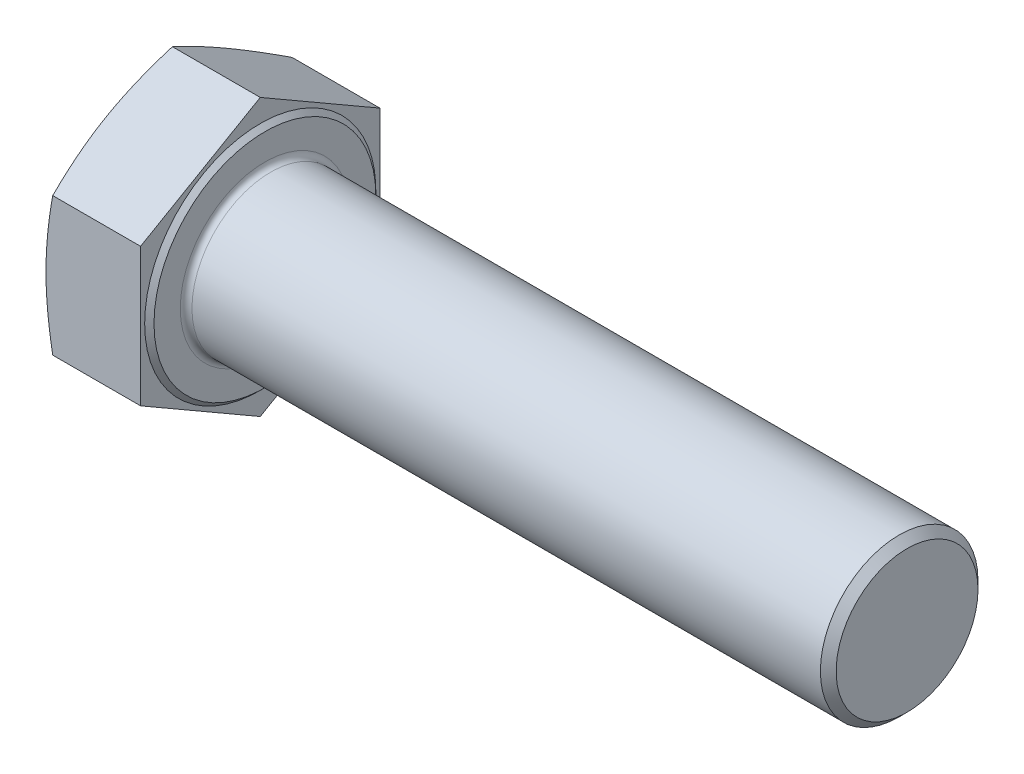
from build123d import *

# Parameters (mm, degrees)
BASEHEAD_DEPTH = 17
SKETCH5_R      = 13.5
BASEBODY_DEPTH = 110
CHAMFER1_SIZE  = 1.35
HEADFILLET_R   = 1


with BuildPart() as part:
    # Sketch2 → BaseHead (new body)
    with BuildSketch(Plane(origin=(0, 0, 0), x_dir=(0, 0, -1), z_dir=(1, 0, 0))):
        Polygon((0, -23.671361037), (20.5, -11.835680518), (20.5, 11.835680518), (0, 23.671361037), (-20.5, 11.835680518), (-20.5, -11.835680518), align=None)
    extrude(amount=BASEHEAD_DEPTH)

    # Sketch3 → BearingFace (revolve, cut)
    with BuildSketch(Plane.XY, mode=Mode.PRIVATE) as bearingface_sk:
        Polygon((17, 23.671361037), (17, 19), (16.2, 19.8), (16.2, 23.671361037), align=None)
    revolve(bearingface_sk.sketch.rotate(Axis((-0.957090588, 0, 0), (1, 0, 0)), 90), axis=Axis((-0.957090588, 0, 0), (1, 0, 0)), mode=Mode.SUBTRACT)

    # Sketch4 → HeadChamfer (revolve, cut)
    with BuildSketch(Plane.XY):
        Polygon((0, 23.671361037), (1.154281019, 23.671361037), (0, 20.5), align=None)
    revolve(axis=Axis((-0.493528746, 0, 0), (1, 0, 0)), mode=Mode.SUBTRACT)

    # Sketch5 → BaseBody (add)
    with BuildSketch(Plane(origin=(17, 0, 0), x_dir=(0, 0, -1), z_dir=(1, 0, 0))):
        with Locations(Location((0, 0, 0), (0, 0, 180))):
            Circle(SKETCH5_R)
    extrude(amount=BASEBODY_DEPTH)

    # Chamfer1
    chamfer1_edges = [part.edges().sort_by_distance(p)[0] for p in [
        (127, 0, -13.5),
    ]]
    chamfer(chamfer1_edges, length=CHAMFER1_SIZE)

    # HeadFillet
    headfillet_edges = [part.edges().sort_by_distance(p)[0] for p in [
        (17, 0, -13.5),
    ]]
    fillet(headfillet_edges, radius=HEADFILLET_R)


solid = part.part
